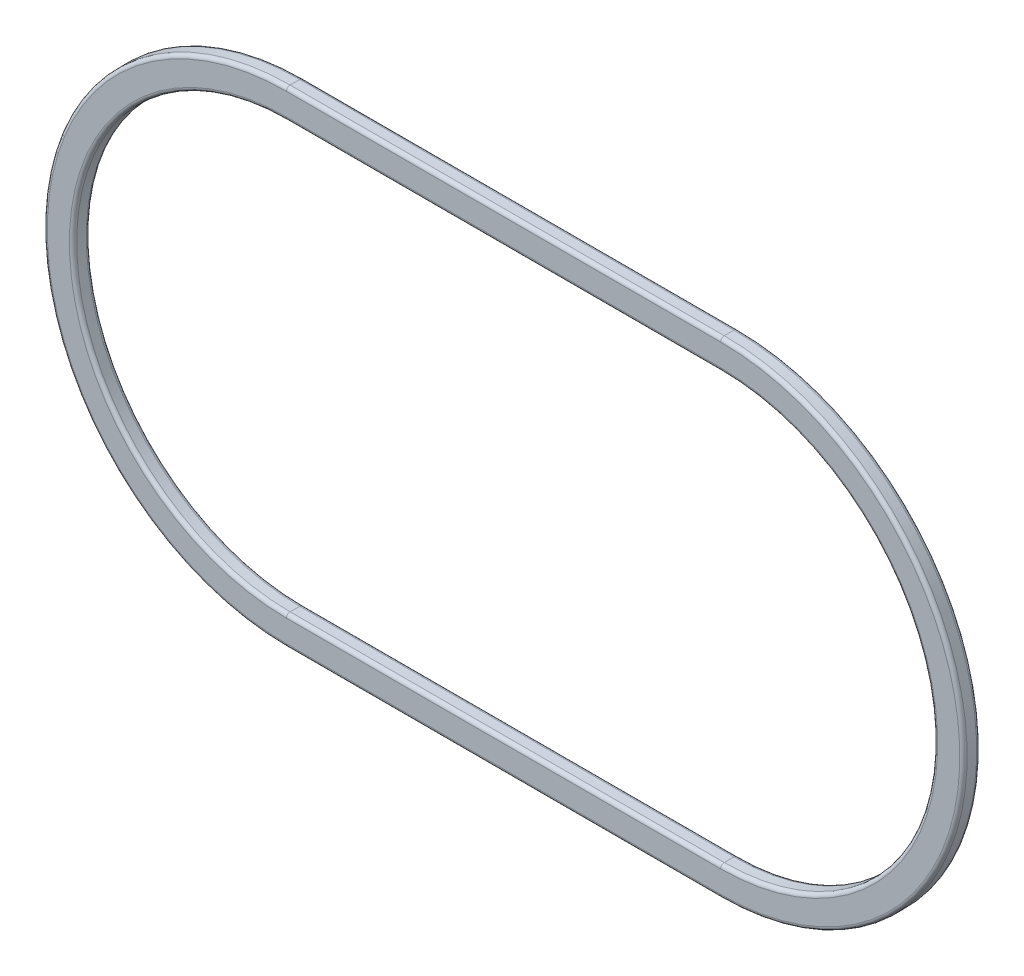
from build123d import *


with BuildPart() as part:
    # Balayage1: sweep along a path in Esquisse1
    with BuildLine(Plane.XY) as balayage1_path:
        Line((0, 33), (59, 33))
        ThreePointArc((59, 33), (92, 0), (59, -33))
        Line((59, -33), (0, -33))
        ThreePointArc((0, -33), (-33, 0), (0, 33))
    # Esquisse2 → Balayage1 (sweep)
    with BuildSketch(Plane(origin=(0, 0, 0), x_dir=(0, 0, -1), z_dir=(1, 0, 0))):
        with BuildLine():
            Line((-3.283524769, 29), (-1.983524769, 29))
            ThreePointArc((-1.983524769, 29), (-1.629971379, 29.146446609), (-1.483524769, 29.5))
            Line((-1.483524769, 29.5), (-1.483524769, 32.5))
            ThreePointArc((-1.483524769, 32.5), (-1.629971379, 32.853553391), (-1.983524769, 33))
            Line((-1.983524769, 33), (-3.283524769, 33))
            ThreePointArc((-3.283524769, 33), (-3.63707816, 32.853553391), (-3.783524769, 32.5))
            Line((-3.783524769, 32.5), (-3.783524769, 29.5))
            ThreePointArc((-3.783524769, 29.5), (-3.63707816, 29.146446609), (-3.283524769, 29))
        make_face()
    sweep(path=balayage1_path.line)


solid = part.part
